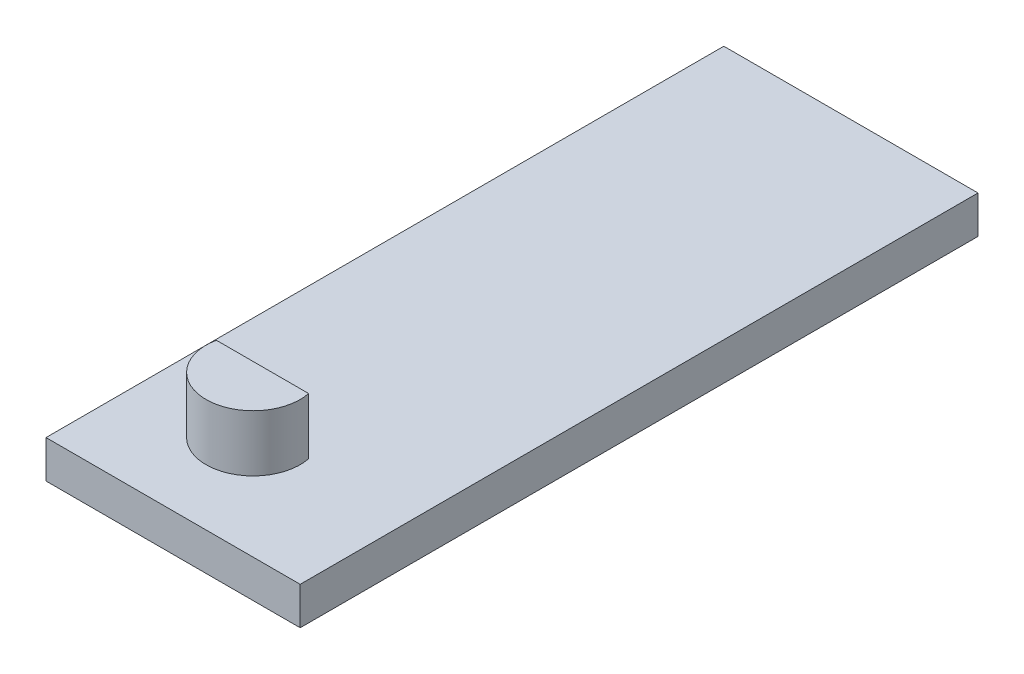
from build123d import *

# Parameters (mm, degrees)
ESQUISSE1_W                  = 27
ESQUISSE1_H                  = 36
EXTRUSION1_DEPTH             = 2
EXTRUSION2_DEPTH             = 3
ENL_V_MAT_EXTRU_1_DEPTH      = 46.099889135
ENL_V_MAT_EXTRU_1_DEPTH_BACK = 46.099889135
ESQUISSE3_W                  = 13.5
ESQUISSE3_H                  = 36


with BuildPart() as part:
    # Esquisse1 → Extrusion1 (new body)
    with BuildSketch(Plane(origin=(0, 0, 0), x_dir=(1, 0, 0), z_dir=(0, 1, 0))):
        with Locations((13.5, 18)):
            Rectangle(ESQUISSE1_W, ESQUISSE1_H)
    extrude(amount=EXTRUSION1_DEPTH)

    # Esquisse2 → Extrusion2 (add)
    with BuildSketch(Plane(origin=(0, 2, 0), x_dir=(-1, 0, 0), z_dir=(0, 1, 0))):
        with BuildLine():
            Line((-23.949489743, -6), (-19.050510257, -6))
            ThreePointArc((-19.050510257, -6), (-21.5, -3), (-23.949489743, -6))
        make_face()
        with BuildLine():
            Line((-7.949489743, -6), (-3.050510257, -6))
            ThreePointArc((-3.050510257, -6), (-5.5, -3), (-7.949489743, -6))
        make_face()
    extrude(amount=EXTRUSION2_DEPTH)

    # Esquisse3 → Enl_v. mat.-Extru.1 (cut, two sides: drawn at the far end of the back side and taken through both)
    with BuildSketch(Plane(origin=(0, 2, 0), x_dir=(-1, 0, 0), z_dir=(0, 1, 0)).offset(-ENL_V_MAT_EXTRU_1_DEPTH_BACK)):
        with Locations((-20.25, -18)):
            Rectangle(ESQUISSE3_W, ESQUISSE3_H)
    extrude(amount=ENL_V_MAT_EXTRU_1_DEPTH + ENL_V_MAT_EXTRU_1_DEPTH_BACK, mode=Mode.SUBTRACT)


solid = part.part
